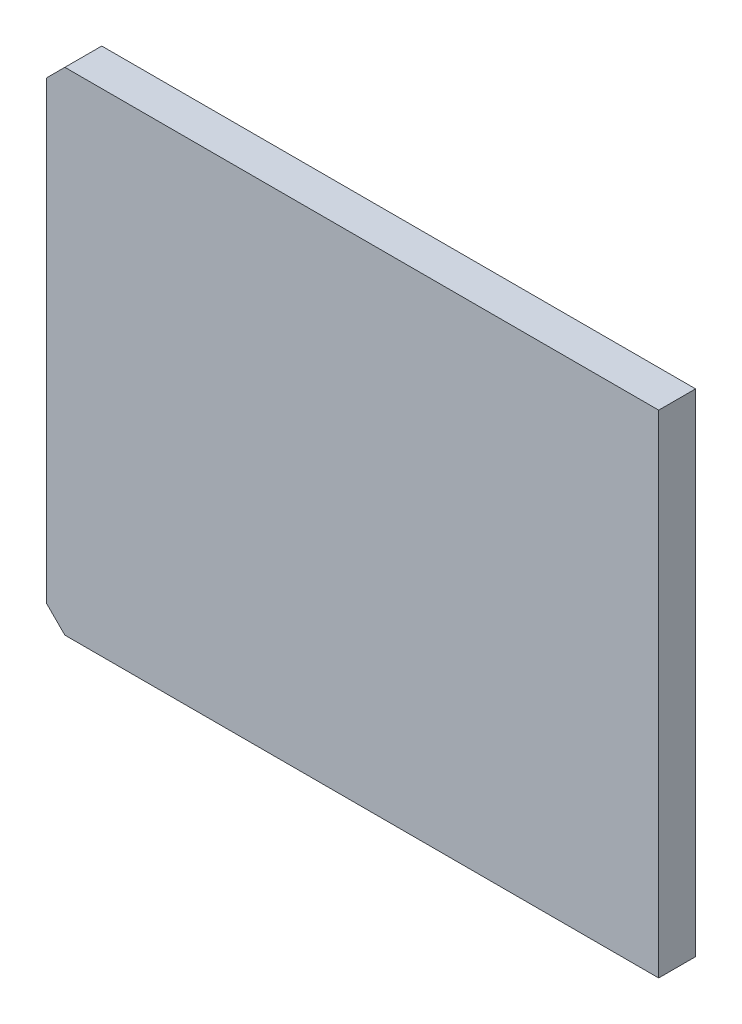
from build123d import *

# Parameters (mm, degrees)
SKETCH1_W           = 49.8
SKETCH1_H           = 40
BOSS_EXTRUDE1_DEPTH = 3
CHAMFER1_SIZE       = 1.5


with BuildPart() as part:
    # Sketch1 → Boss-Extrude1 (new body)
    with BuildSketch(Plane.XY):
        Rectangle(SKETCH1_W, SKETCH1_H)
    extrude(amount=BOSS_EXTRUDE1_DEPTH)

    # Chamfer1
    chamfer1_edges = [part.edges().sort_by_distance(p)[0] for p in [
        (-24.9, -20, 1.5),
        (-24.9, 20, 1.5),
    ]]
    chamfer(chamfer1_edges, length=CHAMFER1_SIZE)


solid = part.part
